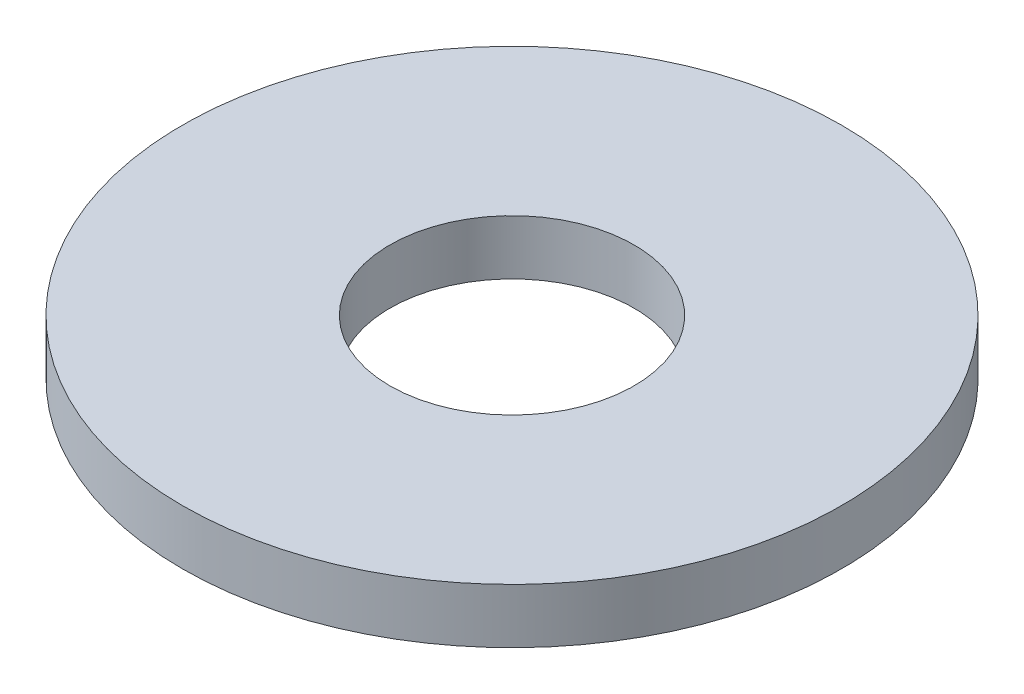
ISO-10303-21;
HEADER;
FILE_DESCRIPTION(('STEP AP214'),'2;1');
FILE_NAME('part.step','',(''),(''),'','','');
FILE_SCHEMA(('AUTOMOTIVE_DESIGN { 1 0 10303 214 1 1 1 1 }'));
ENDSEC;
DATA;
#1=APPLICATION_CONTEXT('core data for automotive mechanical design processes');
#2=APPLICATION_PROTOCOL_DEFINITION('international standard','automotive_design',2000,#1);
#3=PRODUCT_CONTEXT('',#1,'mechanical');
#4=PRODUCT('Part','Part','',(#3));
#5=PRODUCT_RELATED_PRODUCT_CATEGORY('part','',(#4));
#6=PRODUCT_DEFINITION_FORMATION('','',#4);
#7=PRODUCT_DEFINITION_CONTEXT('part definition',#1,'design');
#8=PRODUCT_DEFINITION('design','',#6,#7);
#9=PRODUCT_DEFINITION_SHAPE('','',#8);
#10=(LENGTH_UNIT() NAMED_UNIT(*) SI_UNIT(.MILLI.,.METRE.));
#11=(NAMED_UNIT(*) PLANE_ANGLE_UNIT() SI_UNIT($,.RADIAN.));
#12=(NAMED_UNIT(*) SI_UNIT($,.STERADIAN.) SOLID_ANGLE_UNIT());
#13=UNCERTAINTY_MEASURE_WITH_UNIT(LENGTH_MEASURE(1.E-05),#10,'distance_accuracy_value','');
#14=(GEOMETRIC_REPRESENTATION_CONTEXT(3) GLOBAL_UNCERTAINTY_ASSIGNED_CONTEXT((#13)) GLOBAL_UNIT_ASSIGNED_CONTEXT((#10,
#11,#12)) REPRESENTATION_CONTEXT('',''));
#15=CARTESIAN_POINT('',(0.,0.,0.));
#16=DIRECTION('',(0.,0.,1.));
#17=DIRECTION('',(1.,0.,0.));
#18=AXIS2_PLACEMENT_3D('',#15,#16,#17);
#19=CARTESIAN_POINT('',(0.,0.889,0.));
#20=DIRECTION('',(0.,1.,0.));
#21=DIRECTION('',(0.,0.,1.));
#22=AXIS2_PLACEMENT_3D('',#19,#20,#21);
#23=PLANE('',#22);
#24=CARTESIAN_POINT('',(0.,0.889,0.));
#25=DIRECTION('',(0.,1.,0.));
#26=DIRECTION('',(0.,0.,1.));
#27=AXIS2_PLACEMENT_3D('',#24,#25,#26);
#28=CIRCLE('',#27,5.3467);
#29=CARTESIAN_POINT('',(0.,0.889,5.3467));
#30=VERTEX_POINT('',#29);
#31=EDGE_CURVE('E10',#30,#30,#28,.T.);
#32=ORIENTED_EDGE('',*,*,#31,.T.);
#33=EDGE_LOOP('',(#32));
#34=FACE_BOUND('',#33,.T.);
#35=CARTESIAN_POINT('',(0.,0.889,0.));
#36=DIRECTION('',(0.,1.,0.));
#37=DIRECTION('',(0.,0.,1.));
#38=AXIS2_PLACEMENT_3D('',#35,#36,#37);
#39=CIRCLE('',#38,1.9812);
#40=CARTESIAN_POINT('',(0.,0.889,1.9812));
#41=VERTEX_POINT('',#40);
#42=EDGE_CURVE('E44',#41,#41,#39,.T.);
#43=ORIENTED_EDGE('',*,*,#42,.F.);
#44=EDGE_LOOP('',(#43));
#45=FACE_BOUND('',#44,.T.);
#46=ADVANCED_FACE('F33',(#34,#45),#23,.T.);
#47=CARTESIAN_POINT('',(0.,0.,0.));
#48=DIRECTION('',(0.,1.,0.));
#49=DIRECTION('',(0.,0.,1.));
#50=AXIS2_PLACEMENT_3D('',#47,#48,#49);
#51=PLANE('',#50);
#52=CARTESIAN_POINT('',(0.,0.,0.));
#53=DIRECTION('',(0.,1.,0.));
#54=DIRECTION('',(0.,0.,1.));
#55=AXIS2_PLACEMENT_3D('',#52,#53,#54);
#56=CIRCLE('',#55,5.3467);
#57=CARTESIAN_POINT('',(0.,0.,5.3467));
#58=VERTEX_POINT('',#57);
#59=EDGE_CURVE('E37',#58,#58,#56,.T.);
#60=ORIENTED_EDGE('',*,*,#59,.F.);
#61=EDGE_LOOP('',(#60));
#62=FACE_BOUND('',#61,.T.);
#63=CARTESIAN_POINT('',(0.,0.,0.));
#64=DIRECTION('',(0.,1.,0.));
#65=DIRECTION('',(0.,0.,1.));
#66=AXIS2_PLACEMENT_3D('',#63,#64,#65);
#67=CIRCLE('',#66,1.9812);
#68=CARTESIAN_POINT('',(0.,0.,1.9812));
#69=VERTEX_POINT('',#68);
#70=EDGE_CURVE('E46',#69,#69,#67,.T.);
#71=ORIENTED_EDGE('',*,*,#70,.T.);
#72=EDGE_LOOP('',(#71));
#73=FACE_BOUND('',#72,.T.);
#74=ADVANCED_FACE('F56',(#62,#73),#51,.F.);
#75=CARTESIAN_POINT('',(0.,0.889,0.));
#76=DIRECTION('',(0.,-1.,0.));
#77=DIRECTION('',(0.,0.,-1.));
#78=AXIS2_PLACEMENT_3D('',#75,#76,#77);
#79=CYLINDRICAL_SURFACE('',#78,5.3467);
#80=ORIENTED_EDGE('',*,*,#31,.F.);
#81=EDGE_LOOP('',(#80));
#82=FACE_BOUND('',#81,.T.);
#83=ORIENTED_EDGE('',*,*,#59,.T.);
#84=EDGE_LOOP('',(#83));
#85=FACE_BOUND('',#84,.T.);
#86=ADVANCED_FACE('F35',(#82,#85),#79,.T.);
#87=CARTESIAN_POINT('',(0.,0.889,0.));
#88=DIRECTION('',(0.,-1.,0.));
#89=DIRECTION('',(0.,0.,-1.));
#90=AXIS2_PLACEMENT_3D('',#87,#88,#89);
#91=CYLINDRICAL_SURFACE('',#90,1.9812);
#92=ORIENTED_EDGE('',*,*,#42,.T.);
#93=EDGE_LOOP('',(#92));
#94=FACE_BOUND('',#93,.T.);
#95=ORIENTED_EDGE('',*,*,#70,.F.);
#96=EDGE_LOOP('',(#95));
#97=FACE_BOUND('',#96,.T.);
#98=ADVANCED_FACE('F52',(#94,#97),#91,.F.);
#99=CLOSED_SHELL('',(#46,#74,#86,#98));
#100=MANIFOLD_SOLID_BREP('B2',#99);
#101=ADVANCED_BREP_SHAPE_REPRESENTATION('',(#18,#100),#14);
#102=SHAPE_DEFINITION_REPRESENTATION(#9,#101);
ENDSEC;
END-ISO-10303-21;
